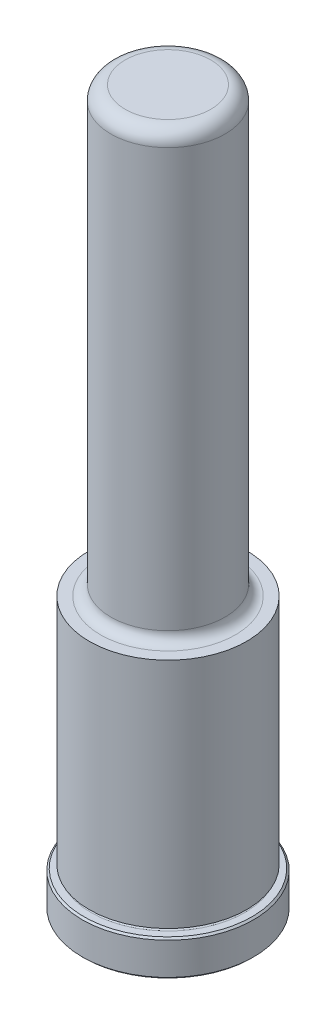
from build123d import *

# Parameters (mm, degrees)
CHAMFER1_SIZE = 0.381
FILLET7_R     = 3.175


with BuildPart() as part:
    # Sketch1 → Revolve1 (revolve)
    with BuildSketch(Plane(origin=(0, 0, 0), x_dir=(0, 0, -1), z_dir=(1, 0, 0)), mode=Mode.PRIVATE) as revolve1_sk:
        with BuildLine():
            Line((0, 0), (19.05, 0))
            Line((19.05, 0), (19.05, 7.9248))
            Line((19.05, 7.9248), (17.0688, 7.9248))
            ThreePointArc((17.0688, 7.9248), (16.6878, 8.3058), (17.0688, 8.6868))
            Line((17.0688, 8.6868), (17.4752, 8.6868))
            Line((17.4752, 8.6868), (17.4752, 60.325))
            Line((17.4752, 60.325), (14.9733, 60.325))
            ThreePointArc((14.9733, 60.325), (13.356853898, 60.994553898), (12.6873, 62.611))
            Line((12.6873, 62.611), (12.6873, 158.75))
            Line((12.6873, 158.75), (0, 158.75))
            Line((0, 158.75), (0, 0))
        make_face()
    revolve(revolve1_sk.sketch.rotate(Axis((0, 0, 0), (0, -1, 0)), 180), axis=Axis((0, 0, 0), (0, -1, 0)))

    # Chamfer1
    chamfer1_edges = [part.edges().sort_by_distance(p)[0] for p in [
        (0, 7.9248, -19.05),
        (0, 0, -19.05),
    ]]
    chamfer(chamfer1_edges, length=CHAMFER1_SIZE)

    # Fillet7
    fillet7_edges = [part.edges().sort_by_distance(p)[0] for p in [
        (0, 158.75, -12.6873),
    ]]
    fillet(fillet7_edges, radius=FILLET7_R)


solid = part.part
